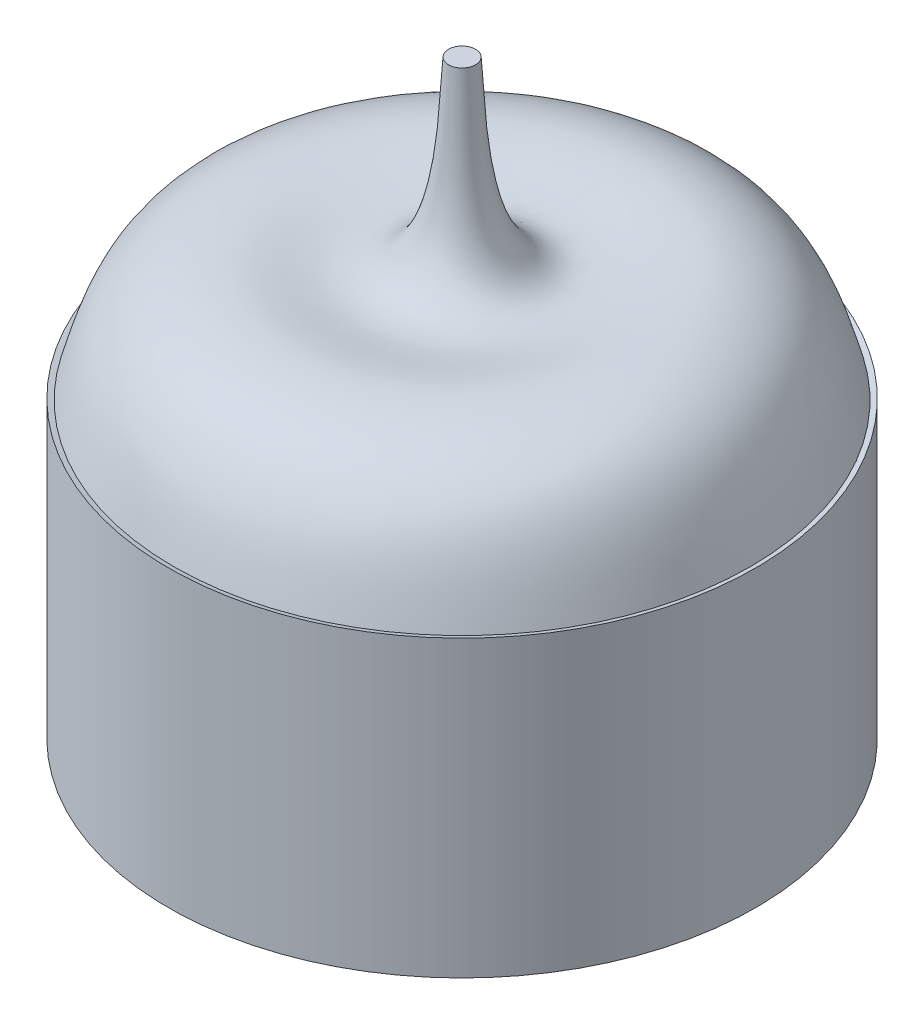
ISO-10303-21;
HEADER;
FILE_DESCRIPTION(('STEP AP214'),'2;1');
FILE_NAME('part.step','',(''),(''),'','','');
FILE_SCHEMA(('AUTOMOTIVE_DESIGN { 1 0 10303 214 1 1 1 1 }'));
ENDSEC;
DATA;
#1=APPLICATION_CONTEXT('core data for automotive mechanical design processes');
#2=APPLICATION_PROTOCOL_DEFINITION('international standard','automotive_design',2000,#1);
#3=PRODUCT_CONTEXT('',#1,'mechanical');
#4=PRODUCT('Part','Part','',(#3));
#5=PRODUCT_RELATED_PRODUCT_CATEGORY('part','',(#4));
#6=PRODUCT_DEFINITION_FORMATION('','',#4);
#7=PRODUCT_DEFINITION_CONTEXT('part definition',#1,'design');
#8=PRODUCT_DEFINITION('design','',#6,#7);
#9=PRODUCT_DEFINITION_SHAPE('','',#8);
#10=(LENGTH_UNIT() NAMED_UNIT(*) SI_UNIT(.MILLI.,.METRE.));
#11=(NAMED_UNIT(*) PLANE_ANGLE_UNIT() SI_UNIT($,.RADIAN.));
#12=(NAMED_UNIT(*) SI_UNIT($,.STERADIAN.) SOLID_ANGLE_UNIT());
#13=UNCERTAINTY_MEASURE_WITH_UNIT(LENGTH_MEASURE(1.E-05),#10,'distance_accuracy_value','');
#14=(GEOMETRIC_REPRESENTATION_CONTEXT(3) GLOBAL_UNCERTAINTY_ASSIGNED_CONTEXT((#13)) GLOBAL_UNIT_ASSIGNED_CONTEXT((#10,
#11,#12)) REPRESENTATION_CONTEXT('',''));
#15=CARTESIAN_POINT('',(0.,0.,0.));
#16=DIRECTION('',(0.,0.,1.));
#17=DIRECTION('',(1.,0.,0.));
#18=AXIS2_PLACEMENT_3D('',#15,#16,#17);
#19=CARTESIAN_POINT('',(0.,54.6934236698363,0.));
#20=DIRECTION('',(0.,1.,0.));
#21=DIRECTION('',(0.,0.,1.));
#22=AXIS2_PLACEMENT_3D('',#19,#20,#21);
#23=CONICAL_SURFACE('',#22,53.8725647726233,1.3006745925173);
#24=CARTESIAN_POINT('',(0.,54.9602724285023,0.));
#25=DIRECTION('',(0.,-1.,0.));
#26=DIRECTION('',(0.,0.,-1.));
#27=AXIS2_PLACEMENT_3D('',#24,#25,#26);
#28=CIRCLE('',#27,54.8363031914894);
#29=CARTESIAN_POINT('',(0.,54.9602724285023,-54.8363031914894));
#30=VERTEX_POINT('',#29);
#31=EDGE_CURVE('E31',#30,#30,#28,.F.);
#32=ORIENTED_EDGE('',*,*,#31,.T.);
#33=EDGE_LOOP('',(#32));
#34=FACE_BOUND('',#33,.T.);
#35=CARTESIAN_POINT('',(0.,54.6934236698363,0.));
#36=DIRECTION('',(0.,-1.,0.));
#37=DIRECTION('',(0.,0.,-1.));
#38=AXIS2_PLACEMENT_3D('',#35,#36,#37);
#39=CIRCLE('',#38,53.8725647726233);
#40=CARTESIAN_POINT('',(0.,54.6934236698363,-53.8725647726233));
#41=VERTEX_POINT('',#40);
#42=EDGE_CURVE('E35',#41,#41,#39,.T.);
#43=ORIENTED_EDGE('',*,*,#42,.T.);
#44=EDGE_LOOP('',(#43));
#45=FACE_BOUND('',#44,.T.);
#46=ADVANCED_FACE('F27',(#34,#45),#23,.F.);
#47=CARTESIAN_POINT('',(-53.8725647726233,54.6934236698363,0.));
#48=CARTESIAN_POINT('',(-53.3541616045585,56.565664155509,0.));
#49=CARTESIAN_POINT('',(-52.8387328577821,58.4262375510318,0.));
#50=CARTESIAN_POINT('',(-51.6973709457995,62.0212487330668,0.));
#51=CARTESIAN_POINT('',(-51.071356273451,63.7554337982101,0.));
#52=CARTESIAN_POINT('',(-49.6005510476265,66.9947336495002,0.));
#53=CARTESIAN_POINT('',(-48.756182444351,68.4991443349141,0.));
#54=CARTESIAN_POINT('',(-47.2491287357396,70.5172295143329,0.));
#55=CARTESIAN_POINT('',(-46.70671005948,71.1503890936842,0.));
#56=CARTESIAN_POINT('',(-45.5271047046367,72.329333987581,0.));
#57=CARTESIAN_POINT('',(-44.8861430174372,72.8785950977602,0.));
#58=CARTESIAN_POINT('',(-41.4573480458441,75.4125846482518,0.));
#59=CARTESIAN_POINT('',(-37.9947695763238,76.7560589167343,0.));
#60=CARTESIAN_POINT('',(-33.3658350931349,77.3797829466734,0.));
#61=CARTESIAN_POINT('',(-32.4252060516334,77.4519405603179,0.));
#62=CARTESIAN_POINT('',(-30.5296237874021,77.4868651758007,0.));
#63=CARTESIAN_POINT('',(-29.5767602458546,77.4467077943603,0.));
#64=CARTESIAN_POINT('',(-26.6883696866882,77.1815007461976,0.));
#65=CARTESIAN_POINT('',(-24.7347180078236,76.8237149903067,0.));
#66=CARTESIAN_POINT('',(-20.9305656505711,76.1428786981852,0.));
#67=CARTESIAN_POINT('',(-19.0814198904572,75.8182735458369,0.));
#68=CARTESIAN_POINT('',(-16.4626525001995,75.6844889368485,0.));
#69=CARTESIAN_POINT('',(-15.6144604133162,75.6990811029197,0.));
#70=CARTESIAN_POINT('',(-14.3876208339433,75.8632804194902,0.));
#71=CARTESIAN_POINT('',(-13.9877231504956,75.9424728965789,0.));
#72=CARTESIAN_POINT('',(-13.2146661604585,76.1485522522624,0.));
#73=CARTESIAN_POINT('',(-12.8404360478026,76.2754359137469,0.));
#74=CARTESIAN_POINT('',(-11.756730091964,76.7243855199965,0.));
#75=CARTESIAN_POINT('',(-11.0867347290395,77.114953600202,0.));
#76=CARTESIAN_POINT('',(-9.85628372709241,78.0524061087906,0.));
#77=CARTESIAN_POINT('',(-9.29571599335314,78.5988220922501,0.));
#78=CARTESIAN_POINT('',(-7.76459087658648,80.4327373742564,0.));
#79=CARTESIAN_POINT('',(-6.94297412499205,81.9123331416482,0.));
#80=CARTESIAN_POINT('',(-5.58537429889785,85.2624550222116,0.));
#81=CARTESIAN_POINT('',(-5.04918926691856,87.1354972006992,0.));
#82=CARTESIAN_POINT('',(-4.17795997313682,91.1854464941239,0.));
#83=CARTESIAN_POINT('',(-3.8434756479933,93.3625715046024,0.));
#84=CARTESIAN_POINT('',(-3.04047055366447,100.206630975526,0.));
#85=CARTESIAN_POINT('',(-2.7722634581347,105.187458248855,0.));
#86=CARTESIAN_POINT('',(-2.51965239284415,110.178789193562,0.));
#87=B_SPLINE_CURVE_WITH_KNOTS('',3,(#47,#48,#49,#50,#51,#52,#53,#54,#55,#56,#57,#58,#59,#60,#61,
#62,#63,#64,#65,#66,#67,#68,#69,#70,#71,#72,#73,#74,#75,#76,#77,#78,#79,#80,#81,#82,#83,#84,#85,
#86),.UNSPECIFIED.,.F.,.F.,(4,2,2,2,2,2,2,2,2,2,2,2,2,2,2,2,2,2,2,4),(0.,0.0625000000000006,
0.125000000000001,0.187500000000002,0.218750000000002,0.250000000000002,0.375000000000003,
0.406250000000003,0.437500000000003,0.500000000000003,0.562500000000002,0.593750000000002,
0.609375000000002,0.625000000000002,0.656250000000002,0.687500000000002,0.750000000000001,
0.812500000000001,0.875000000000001,1.),.UNSPECIFIED.);
#88=CARTESIAN_POINT('',(0.,54.9602724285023,0.));
#89=DIRECTION('',(0.,-1.,0.));
#90=AXIS1_PLACEMENT('',#88,#89);
#91=SURFACE_OF_REVOLUTION('',#87,#90);
#92=CARTESIAN_POINT('',(0.,110.178789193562,0.));
#93=DIRECTION('',(0.,-1.,0.));
#94=DIRECTION('',(0.,0.,-1.));
#95=AXIS2_PLACEMENT_3D('',#92,#93,#94);
#96=CIRCLE('',#95,2.51965239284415);
#97=CARTESIAN_POINT('',(0.,110.178789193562,-2.51965239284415));
#98=VERTEX_POINT('',#97);
#99=EDGE_CURVE('E10',#98,#98,#96,.T.);
#100=ORIENTED_EDGE('',*,*,#99,.T.);
#101=EDGE_LOOP('',(#100));
#102=FACE_BOUND('',#101,.T.);
#103=ORIENTED_EDGE('',*,*,#42,.F.);
#104=EDGE_LOOP('',(#103));
#105=FACE_BOUND('',#104,.T.);
#106=ADVANCED_FACE('F62',(#102,#105),#91,.F.);
#107=CARTESIAN_POINT('',(-3.47045875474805,110.178789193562,0.));
#108=DIRECTION('',(0.,1.,0.));
#109=DIRECTION('',(0.,0.,1.));
#110=AXIS2_PLACEMENT_3D('',#107,#108,#109);
#111=PLANE('',#110);
#112=ORIENTED_EDGE('',*,*,#99,.F.);
#113=EDGE_LOOP('',(#112));
#114=FACE_BOUND('',#113,.T.);
#115=ADVANCED_FACE('F56',(#114),#111,.T.);
#116=CARTESIAN_POINT('',(0.,500000.,0.));
#117=DIRECTION('',(0.,-1.,0.));
#118=DIRECTION('',(0.,0.,-1.));
#119=AXIS2_PLACEMENT_3D('',#116,#117,#118);
#120=CYLINDRICAL_SURFACE('',#119,54.8363031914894);
#121=CARTESIAN_POINT('',(0.,0.,0.));
#122=DIRECTION('',(0.,1.,0.));
#123=DIRECTION('',(0.,0.,1.));
#124=AXIS2_PLACEMENT_3D('',#121,#122,#123);
#125=CIRCLE('',#124,54.8363031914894);
#126=CARTESIAN_POINT('',(0.,0.,-54.8363031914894));
#127=VERTEX_POINT('',#126);
#128=EDGE_CURVE('E45',#127,#127,#125,.T.);
#129=CARTESIAN_POINT('',(0.,0.,-54.8363031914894));
#130=CARTESIAN_POINT('',(0.,0.572502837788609,-54.8363031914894));
#131=CARTESIAN_POINT('',(0.,1.14500567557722,-54.8363031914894));
#132=CARTESIAN_POINT('',(0.,2.29001135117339,-54.8363031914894));
#133=CARTESIAN_POINT('',(0.,2.86251418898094,-54.8363031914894));
#134=CARTESIAN_POINT('',(0.,4.00751986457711,-54.8363031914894));
#135=CARTESIAN_POINT('',(0.,4.58002270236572,-54.8363031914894));
#136=CARTESIAN_POINT('',(0.,5.72502837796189,-54.8363031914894));
#137=CARTESIAN_POINT('',(0.,6.29753121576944,-54.8363031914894));
#138=CARTESIAN_POINT('',(0.,7.44253689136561,-54.8363031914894));
#139=CARTESIAN_POINT('',(0.,8.01503972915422,-54.8363031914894));
#140=CARTESIAN_POINT('',(0.,9.16004540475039,-54.8363031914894));
#141=CARTESIAN_POINT('',(0.,9.73254824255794,-54.8363031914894));
#142=CARTESIAN_POINT('',(0.,10.8775539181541,-54.8363031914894));
#143=CARTESIAN_POINT('',(0.,11.4500567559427,-54.8363031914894));
#144=CARTESIAN_POINT('',(0.,12.5950624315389,-54.8363031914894));
#145=CARTESIAN_POINT('',(0.,13.1675652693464,-54.8363031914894));
#146=CARTESIAN_POINT('',(0.,14.3125709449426,-54.8363031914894));
#147=CARTESIAN_POINT('',(0.,14.8850737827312,-54.8363031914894));
#148=CARTESIAN_POINT('',(0.,16.0300794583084,-54.8363031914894));
#149=CARTESIAN_POINT('',(0.,16.6025822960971,-54.8363031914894));
#150=CARTESIAN_POINT('',(0.,17.7475879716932,-54.8363031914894));
#151=CARTESIAN_POINT('',(0.,18.3200908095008,-54.8363031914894));
#152=CARTESIAN_POINT('',(0.,19.4650964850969,-54.8363031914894));
#153=CARTESIAN_POINT('',(0.,20.0375993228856,-54.8363031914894));
#154=CARTESIAN_POINT('',(0.,21.1826049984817,-54.8363031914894));
#155=CARTESIAN_POINT('',(0.,21.7551078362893,-54.8363031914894));
#156=CARTESIAN_POINT('',(0.,22.9001135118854,-54.8363031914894));
#157=CARTESIAN_POINT('',(0.,23.4726163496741,-54.8363031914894));
#158=CARTESIAN_POINT('',(0.,24.6176220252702,-54.8363031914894));
#159=CARTESIAN_POINT('',(0.,25.1901248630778,-54.8363031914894));
#160=CARTESIAN_POINT('',(0.,26.3351305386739,-54.8363031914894));
#161=CARTESIAN_POINT('',(0.,26.9076333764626,-54.8363031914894));
#162=CARTESIAN_POINT('',(0.,28.0526390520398,-54.8363031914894));
#163=CARTESIAN_POINT('',(0.,28.6251418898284,-54.8363031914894));
#164=CARTESIAN_POINT('',(0.,29.7701475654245,-54.8363031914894));
#165=CARTESIAN_POINT('',(0.,30.3426504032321,-54.8363031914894));
#166=CARTESIAN_POINT('',(0.,31.4876560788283,-54.8363031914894));
#167=CARTESIAN_POINT('',(0.,32.0601589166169,-54.8363031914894));
#168=CARTESIAN_POINT('',(0.,33.205164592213,-54.8363031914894));
#169=CARTESIAN_POINT('',(0.,33.7776674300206,-54.8363031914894));
#170=CARTESIAN_POINT('',(0.,34.9226731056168,-54.8363031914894));
#171=CARTESIAN_POINT('',(0.,35.4951759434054,-54.8363031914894));
#172=CARTESIAN_POINT('',(0.,36.6401816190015,-54.8363031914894));
#173=CARTESIAN_POINT('',(0.,37.2126844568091,-54.8363031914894));
#174=CARTESIAN_POINT('',(0.,38.3576901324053,-54.8363031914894));
#175=CARTESIAN_POINT('',(0.,38.9301929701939,-54.8363031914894));
#176=CARTESIAN_POINT('',(0.,40.0751986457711,-54.8363031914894));
#177=CARTESIAN_POINT('',(0.,40.6477014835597,-54.8363031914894));
#178=CARTESIAN_POINT('',(0.,41.7927071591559,-54.8363031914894));
#179=CARTESIAN_POINT('',(0.,42.3652099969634,-54.8363031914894));
#180=CARTESIAN_POINT('',(0.,43.5102156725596,-54.8363031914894));
#181=CARTESIAN_POINT('',(0.,44.0827185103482,-54.8363031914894));
#182=CARTESIAN_POINT('',(0.,45.2277241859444,-54.8363031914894));
#183=CARTESIAN_POINT('',(0.,45.8002270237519,-54.8363031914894));
#184=CARTESIAN_POINT('',(0.,46.9452326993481,-54.8363031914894));
#185=CARTESIAN_POINT('',(0.,47.5177355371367,-54.8363031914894));
#186=CARTESIAN_POINT('',(0.,48.6627412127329,-54.8363031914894));
#187=CARTESIAN_POINT('',(0.,49.2352440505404,-54.8363031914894));
#188=CARTESIAN_POINT('',(0.,50.3802497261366,-54.8363031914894));
#189=CARTESIAN_POINT('',(0.,50.9527525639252,-54.8363031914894));
#190=CARTESIAN_POINT('',(0.,52.0977582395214,-54.8363031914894));
#191=CARTESIAN_POINT('',(0.,52.6702610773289,-54.8363031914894));
#192=CARTESIAN_POINT('',(0.,53.8152667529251,-54.8363031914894));
#193=CARTESIAN_POINT('',(0.,54.3877695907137,-54.8363031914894));
#194=CARTESIAN_POINT('',(0.,54.9602724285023,-54.8363031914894));
#195=B_SPLINE_CURVE_WITH_KNOTS('',3,(#129,#130,#131,#132,#133,#134,#135,#136,#137,#138,#139,
#140,#141,#142,#143,#144,#145,#146,#147,#148,#149,#150,#151,#152,#153,#154,#155,#156,#157,#158,
#159,#160,#161,#162,#163,#164,#165,#166,#167,#168,#169,#170,#171,#172,#173,#174,#175,#176,#177,
#178,#179,#180,#181,#182,#183,#184,#185,#186,#187,#188,#189,#190,#191,#192,#193,#194),
.UNSPECIFIED.,.F.,.F.,(4,2,2,2,2,2,2,2,2,2,2,2,2,2,2,2,2,2,2,2,2,2,2,2,2,2,2,2,2,2,2,2,4),(0.,
1.71750851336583,3.4350170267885,5.15252554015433,6.870034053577,8.58754256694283,
10.3050510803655,12.0225595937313,13.740068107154,15.4575766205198,17.1750851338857,
18.8925936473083,20.6101021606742,22.3276106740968,24.0451191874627,25.7626277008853,
27.4801362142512,29.197644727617,30.9151532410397,32.6326617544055,34.3501702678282,
36.067678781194,37.7851872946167,39.5026958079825,41.2202043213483,42.937712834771,
44.6552213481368,46.3727298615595,48.0902383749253,49.807746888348,51.5252554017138,
53.2427639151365,54.9602724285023),.UNSPECIFIED.);
#196=EDGE_CURVE('BSEAM29',#127,#30,#195,.T.);
#197=ORIENTED_EDGE('',*,*,#128,.T.);
#198=ORIENTED_EDGE('',*,*,#31,.F.);
#199=ORIENTED_EDGE('',*,*,#196,.T.);
#200=ORIENTED_EDGE('',*,*,#196,.F.);
#201=EDGE_LOOP('',(#197,#199,#198,#200));
#202=FACE_BOUND('',#201,.T.);
#203=ADVANCED_FACE('F29',(#202),#120,.T.);
#204=CARTESIAN_POINT('',(0.,0.,0.));
#205=DIRECTION('',(0.,1.,0.));
#206=DIRECTION('',(0.,0.,1.));
#207=AXIS2_PLACEMENT_3D('',#204,#205,#206);
#208=PLANE('',#207);
#209=ORIENTED_EDGE('',*,*,#128,.F.);
#210=EDGE_LOOP('',(#209));
#211=FACE_BOUND('',#210,.T.);
#212=ADVANCED_FACE('F55',(#211),#208,.F.);
#213=CLOSED_SHELL('',(#46,#106,#115,#203,#212));
#214=MANIFOLD_SOLID_BREP('B2',#213);
#215=ADVANCED_BREP_SHAPE_REPRESENTATION('',(#18,#214),#14);
#216=SHAPE_DEFINITION_REPRESENTATION(#9,#215);
ENDSEC;
END-ISO-10303-21;
